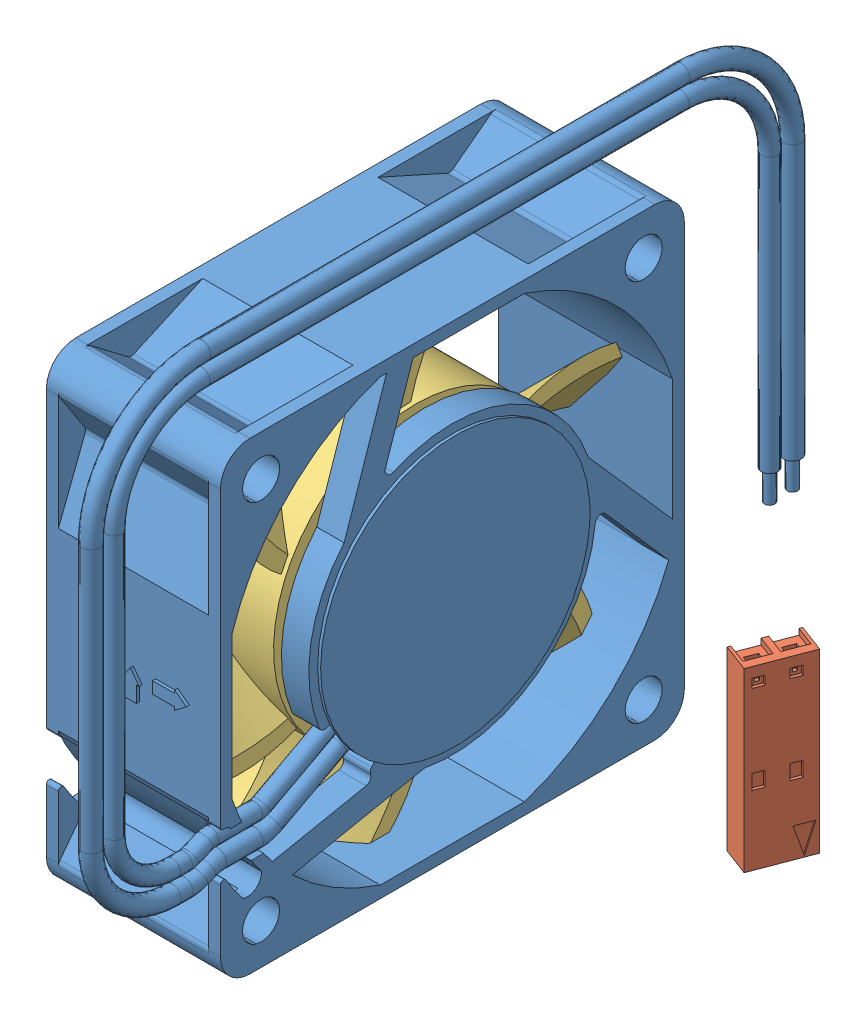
SolidWorks assembly User Library-Fan Kit Fan Assembly.SLDASM, configuration Default (file format 4400). Lengths in mm.
Overall size (15.27 54.22 62.03).
4 component instances, 3 part files, 3 mates.
Components (placement in the parent):
- User Library-Fan Kit Fan Assembly_DELTA FAN PART FOR HARDWARE KIT-1: User Library-Fan Kit Fan Assembly_DELTA FAN PART FOR HARDWARE KIT.SLDPRT [Default] at origin size (15.27 48.41 62.03)
- User Library-Fan Kit Fan Assembly_430-0023-1 Molex Crimp Housing Single Row 2 pin-1: User Library-Fan Kit Fan Assembly_430-0023-1 Molex Crimp Housing Single Row 2 pin.SLDPRT [Default] at (-1.4595 -7.3108 -29.146) x (-0.35584 0 0.934547) z (0.934547 0 0.35584) size (5.05 15.24 2.51) (hidden)
- User Library-Fan Kit Fan Assembly_DELTA FAN-1: User Library-Fan Kit Fan Assembly_DELTA FAN.SLDPRT [Default] at (-3.1876 20.0025 0) x (-1 0 0) z (0 -0.433667 -0.901073) size (10.54 38.68 38.68)
- User Library-Fan Kit Fan Assembly_430-0023-1 Molex Crimp Housing Single Row 2 pin-2: User Library-Fan Kit Fan Assembly_430-0023-1 Molex Crimp Housing Single Row 2 pin.SLDPRT [Default] at (-1.0531 9.4179 -29.0637) x (-0.035846 0 0.999357) z (0.999357 0 0.035846) size (5.05 15.24 2.51) (hidden)
Mates (geometry in assembly coordinates):
- Concentric1: concentric anti-aligned: circle of User Library-Fan Kit Fan Assembly_DELTA FAN PART FOR HARDWARE KIT-1; circle of User Library-Fan Kit Fan Assembly_430-0023-1 Molex Crimp Housing Single Row 2 pin-1
- Concentric2: concentric aligned: circle of User Library-Fan Kit Fan Assembly_DELTA FAN PART FOR HARDWARE KIT-1; circle of User Library-Fan Kit Fan Assembly_DELTA FAN-1
- Concentric3: concentric anti-aligned: circle of User Library-Fan Kit Fan Assembly_430-0023-1 Molex Crimp Housing Single Row 2 pin-2; cylinder of User Library-Fan Kit Fan Assembly_DELTA FAN PART FOR HARDWARE KIT-1 through (-1.0076 38.0638 -30.3329) axis (0 -1 0) radius 0.762
